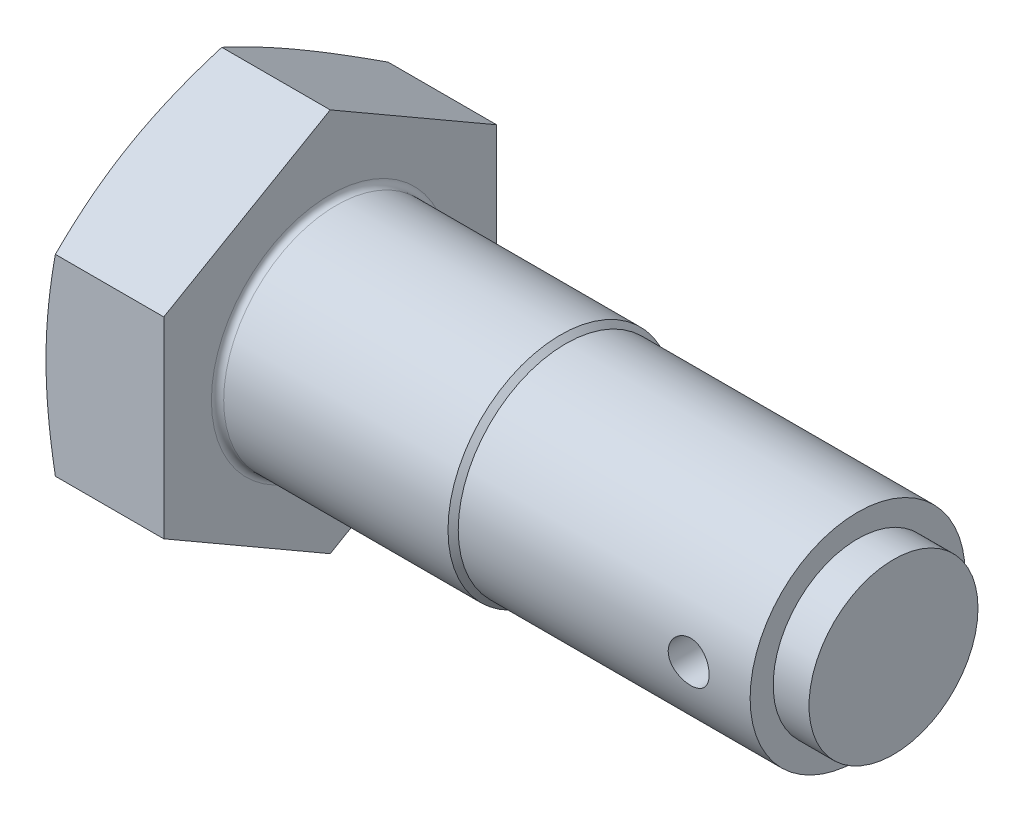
ISO-10303-21;
HEADER;
FILE_DESCRIPTION(('STEP AP214'),'2;1');
FILE_NAME('part.step','',(''),(''),'','','');
FILE_SCHEMA(('AUTOMOTIVE_DESIGN { 1 0 10303 214 1 1 1 1 }'));
ENDSEC;
DATA;
#1=APPLICATION_CONTEXT('core data for automotive mechanical design processes');
#2=APPLICATION_PROTOCOL_DEFINITION('international standard','automotive_design',2000,#1);
#3=PRODUCT_CONTEXT('',#1,'mechanical');
#4=PRODUCT('Part','Part','',(#3));
#5=PRODUCT_RELATED_PRODUCT_CATEGORY('part','',(#4));
#6=PRODUCT_DEFINITION_FORMATION('','',#4);
#7=PRODUCT_DEFINITION_CONTEXT('part definition',#1,'design');
#8=PRODUCT_DEFINITION('design','',#6,#7);
#9=PRODUCT_DEFINITION_SHAPE('','',#8);
#10=(LENGTH_UNIT() NAMED_UNIT(*) SI_UNIT(.MILLI.,.METRE.));
#11=(NAMED_UNIT(*) PLANE_ANGLE_UNIT() SI_UNIT($,.RADIAN.));
#12=(NAMED_UNIT(*) SI_UNIT($,.STERADIAN.) SOLID_ANGLE_UNIT());
#13=UNCERTAINTY_MEASURE_WITH_UNIT(LENGTH_MEASURE(1.E-05),#10,'distance_accuracy_value','');
#14=(GEOMETRIC_REPRESENTATION_CONTEXT(3) GLOBAL_UNCERTAINTY_ASSIGNED_CONTEXT((#13)) GLOBAL_UNIT_ASSIGNED_CONTEXT((#10,
#11,#12)) REPRESENTATION_CONTEXT('',''));
#15=CARTESIAN_POINT('',(0.,0.,0.));
#16=DIRECTION('',(0.,0.,1.));
#17=DIRECTION('',(1.,0.,0.));
#18=AXIS2_PLACEMENT_3D('',#15,#16,#17);
#19=CARTESIAN_POINT('',(23.,-18.7638837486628,32.5));
#20=DIRECTION('',(0.,0.866025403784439,-0.5));
#21=DIRECTION('',(0.,0.5,0.866025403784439));
#22=AXIS2_PLACEMENT_3D('',#19,#20,#21);
#23=PLANE('',#22);
#24=CARTESIAN_POINT('',(1.8299997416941,-37.5278829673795,-0.000199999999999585));
#25=CARTESIAN_POINT('',(1.68857418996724,-37.139311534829,0.672825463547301));
#26=CARTESIAN_POINT('',(1.55351316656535,-36.7501472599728,1.34687776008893));
#27=CARTESIAN_POINT('',(1.29751061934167,-35.9706235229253,2.69705247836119));
#28=CARTESIAN_POINT('',(1.17657043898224,-35.5802639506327,3.37317509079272));
#29=CARTESIAN_POINT('',(0.950141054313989,-34.7981155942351,4.72789578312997));
#30=CARTESIAN_POINT('',(0.844663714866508,-34.4063259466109,5.40649535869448));
#31=CARTESIAN_POINT('',(0.650670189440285,-33.6217048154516,6.76549902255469));
#32=CARTESIAN_POINT('',(0.562153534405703,-33.2288733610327,7.44590306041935));
#33=CARTESIAN_POINT('',(0.404133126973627,-32.4459927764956,8.80189200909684));
#34=CARTESIAN_POINT('',(0.334457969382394,-32.0559523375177,9.47746186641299));
#35=CARTESIAN_POINT('',(0.214136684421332,-31.2751323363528,10.8298817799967));
#36=CARTESIAN_POINT('',(0.163490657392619,-30.8843527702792,11.5067318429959));
#37=CARTESIAN_POINT('',(0.0821085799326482,-30.1024159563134,12.8610861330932));
#38=CARTESIAN_POINT('',(0.0513652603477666,-29.7112588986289,13.5385900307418));
#39=CARTESIAN_POINT('',(0.0103110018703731,-28.9286764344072,14.8940626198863));
#40=CARTESIAN_POINT('',(0.,-28.5372510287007,15.5720313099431));
#41=CARTESIAN_POINT('',(0.,-27.7544002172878,16.9279686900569));
#42=CARTESIAN_POINT('',(0.0103110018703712,-27.3629748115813,17.6059373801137));
#43=CARTESIAN_POINT('',(0.0513652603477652,-26.5803923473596,18.9614099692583));
#44=CARTESIAN_POINT('',(0.0821085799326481,-26.1892352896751,19.6389138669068));
#45=CARTESIAN_POINT('',(0.16349065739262,-25.4072984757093,20.9932681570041));
#46=CARTESIAN_POINT('',(0.214136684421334,-25.0165189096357,21.6701182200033));
#47=CARTESIAN_POINT('',(0.334457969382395,-24.2356989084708,23.022538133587));
#48=CARTESIAN_POINT('',(0.404133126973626,-23.8456584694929,23.6981079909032));
#49=CARTESIAN_POINT('',(0.562153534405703,-23.0627778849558,25.0540969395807));
#50=CARTESIAN_POINT('',(0.650670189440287,-22.6699464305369,25.7345009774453));
#51=CARTESIAN_POINT('',(0.844663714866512,-21.8853252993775,27.0935046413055));
#52=CARTESIAN_POINT('',(0.950141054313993,-21.4935356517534,27.77210421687));
#53=CARTESIAN_POINT('',(1.17657043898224,-20.7113872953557,29.1268249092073));
#54=CARTESIAN_POINT('',(1.29751061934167,-20.3210277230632,29.8029475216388));
#55=CARTESIAN_POINT('',(1.55351316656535,-19.5415039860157,31.1531222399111));
#56=CARTESIAN_POINT('',(1.68857418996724,-19.1523397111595,31.8271745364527));
#57=CARTESIAN_POINT('',(1.82999974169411,-18.763768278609,32.5002));
#58=B_SPLINE_CURVE_WITH_KNOTS('',3,(#24,#25,#26,#27,#28,#29,#30,#31,#32,#33,#34,#35,#36,#37,#38,
#39,#40,#41,#42,#43,#44,#45,#46,#47,#48,#49,#50,#51,#52,#53,#54,#55,#56,#57),.UNSPECIFIED.,.F.,
.F.,(4,2,2,2,2,2,2,2,2,2,2,2,2,2,2,2,4),(0.,2.36973307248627,4.73969141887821,7.11145885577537,
9.48316069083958,11.8324994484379,14.1818505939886,16.5303431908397,18.8788285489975,
21.2273139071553,23.5758065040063,25.925157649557,28.2744964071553,30.6461982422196,
33.0179656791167,35.3879240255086,37.7576570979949),.UNSPECIFIED.);
#59=CARTESIAN_POINT('',(1.8299577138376,-37.5277674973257,0.));
#60=VERTEX_POINT('',#59);
#61=CARTESIAN_POINT('',(0.,-28.1458256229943,16.25));
#62=VERTEX_POINT('',#61);
#63=EDGE_CURVE('E279',#60,#62,#58,.T.);
#64=ORIENTED_EDGE('',*,*,#63,.F.);
#65=DIRECTION('',(-1.,0.,0.));
#66=VECTOR('',#65,1.);
#67=CARTESIAN_POINT('',(23.,-37.5277674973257,0.));
#68=LINE('',#67,#66);
#69=CARTESIAN_POINT('',(23.,-37.5277674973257,0.));
#70=VERTEX_POINT('',#69);
#71=EDGE_CURVE('E149',#70,#60,#68,.T.);
#72=ORIENTED_EDGE('',*,*,#71,.F.);
#73=DIRECTION('',(0.,-0.5,-0.866025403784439));
#74=VECTOR('',#73,1.);
#75=CARTESIAN_POINT('',(23.,-18.7638837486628,32.5));
#76=LINE('',#75,#74);
#77=CARTESIAN_POINT('',(23.,-18.7638837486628,32.5));
#78=VERTEX_POINT('',#77);
#79=EDGE_CURVE('E291',#78,#70,#76,.T.);
#80=ORIENTED_EDGE('',*,*,#79,.F.);
#81=DIRECTION('',(-1.,0.,0.));
#82=VECTOR('',#81,1.);
#83=CARTESIAN_POINT('',(23.,-18.7638837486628,32.5));
#84=LINE('',#83,#82);
#85=CARTESIAN_POINT('',(1.8299577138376,-18.7638837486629,32.5));
#86=VERTEX_POINT('',#85);
#87=EDGE_CURVE('E136',#78,#86,#84,.T.);
#88=ORIENTED_EDGE('',*,*,#87,.T.);
#89=EDGE_CURVE('E130',#62,#86,#58,.T.);
#90=ORIENTED_EDGE('',*,*,#89,.F.);
#91=EDGE_LOOP('',(#64,#72,#80,#88,#90));
#92=FACE_BOUND('',#91,.T.);
#93=ADVANCED_FACE('F35',(#92),#23,.F.);
#94=CARTESIAN_POINT('',(23.,-37.5277674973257,0.));
#95=DIRECTION('',(0.,0.866025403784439,0.5));
#96=DIRECTION('',(0.,-0.5,0.866025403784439));
#97=AXIS2_PLACEMENT_3D('',#94,#95,#96);
#98=PLANE('',#97);
#99=CARTESIAN_POINT('',(1.82999974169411,-18.763768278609,-32.5002));
#100=CARTESIAN_POINT('',(1.68857418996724,-19.1523397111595,-31.8271745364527));
#101=CARTESIAN_POINT('',(1.55351316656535,-19.5415039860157,-31.1531222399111));
#102=CARTESIAN_POINT('',(1.29751061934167,-20.3210277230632,-29.8029475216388));
#103=CARTESIAN_POINT('',(1.17657043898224,-20.7113872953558,-29.1268249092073));
#104=CARTESIAN_POINT('',(0.950141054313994,-21.4935356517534,-27.77210421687));
#105=CARTESIAN_POINT('',(0.844663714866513,-21.8853252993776,-27.0935046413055));
#106=CARTESIAN_POINT('',(0.650670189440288,-22.6699464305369,-25.7345009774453));
#107=CARTESIAN_POINT('',(0.562153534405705,-23.0627778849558,-25.0540969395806));
#108=CARTESIAN_POINT('',(0.404133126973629,-23.8456584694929,-23.6981079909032));
#109=CARTESIAN_POINT('',(0.334457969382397,-24.2356989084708,-23.022538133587));
#110=CARTESIAN_POINT('',(0.214136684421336,-25.0165189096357,-21.6701182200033));
#111=CARTESIAN_POINT('',(0.163490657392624,-25.4072984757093,-20.9932681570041));
#112=CARTESIAN_POINT('',(0.0821085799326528,-26.1892352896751,-19.6389138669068));
#113=CARTESIAN_POINT('',(0.0513652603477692,-26.5803923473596,-18.9614099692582));
#114=CARTESIAN_POINT('',(0.0103110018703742,-27.3629748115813,-17.6059373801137));
#115=CARTESIAN_POINT('',(0.,-27.7544002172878,-16.9279686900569));
#116=CARTESIAN_POINT('',(0.,-28.5372510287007,-15.5720313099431));
#117=CARTESIAN_POINT('',(0.0103110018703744,-28.9286764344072,-14.8940626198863));
#118=CARTESIAN_POINT('',(0.0513652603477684,-29.7112588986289,-13.5385900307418));
#119=CARTESIAN_POINT('',(0.0821085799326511,-30.1024159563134,-12.8610861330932));
#120=CARTESIAN_POINT('',(0.163490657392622,-30.8843527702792,-11.5067318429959));
#121=CARTESIAN_POINT('',(0.214136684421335,-31.2751323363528,-10.8298817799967));
#122=CARTESIAN_POINT('',(0.334457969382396,-32.0559523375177,-9.47746186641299));
#123=CARTESIAN_POINT('',(0.404133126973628,-32.4459927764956,-8.80189200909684));
#124=CARTESIAN_POINT('',(0.562153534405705,-33.2288733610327,-7.44590306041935));
#125=CARTESIAN_POINT('',(0.650670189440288,-33.6217048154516,-6.76549902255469));
#126=CARTESIAN_POINT('',(0.844663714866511,-34.4063259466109,-5.40649535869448));
#127=CARTESIAN_POINT('',(0.950141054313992,-34.7981155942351,-4.72789578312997));
#128=CARTESIAN_POINT('',(1.17657043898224,-35.5802639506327,-3.37317509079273));
#129=CARTESIAN_POINT('',(1.29751061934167,-35.9706235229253,-2.6970524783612));
#130=CARTESIAN_POINT('',(1.55351316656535,-36.7501472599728,-1.34687776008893));
#131=CARTESIAN_POINT('',(1.68857418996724,-37.139311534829,-0.672825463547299));
#132=CARTESIAN_POINT('',(1.8299997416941,-37.5278829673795,0.000200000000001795));
#133=B_SPLINE_CURVE_WITH_KNOTS('',3,(#99,#100,#101,#102,#103,#104,#105,#106,#107,#108,#109,#110,
#111,#112,#113,#114,#115,#116,#117,#118,#119,#120,#121,#122,#123,#124,#125,#126,#127,#128,#129,
#130,#131,#132),.UNSPECIFIED.,.F.,.F.,(4,2,2,2,2,2,2,2,2,2,2,2,2,2,2,2,4),(0.,2.36973307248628,
4.73969141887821,7.11145885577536,9.48316069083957,11.8324994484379,14.1818505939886,
16.5303431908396,18.8788285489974,21.2273139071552,23.5758065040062,25.925157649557,
28.2744964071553,30.6461982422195,33.0179656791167,35.3879240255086,37.7576570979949),.UNSPECIFIED.);
#134=CARTESIAN_POINT('',(1.8299577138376,-18.7638837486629,-32.5));
#135=VERTEX_POINT('',#134);
#136=CARTESIAN_POINT('',(0.,-28.1458256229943,-16.25));
#137=VERTEX_POINT('',#136);
#138=EDGE_CURVE('E226',#135,#137,#133,.T.);
#139=ORIENTED_EDGE('',*,*,#138,.F.);
#140=DIRECTION('',(-1.,0.,0.));
#141=VECTOR('',#140,1.);
#142=CARTESIAN_POINT('',(23.,-18.7638837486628,-32.5));
#143=LINE('',#142,#141);
#144=CARTESIAN_POINT('',(23.,-18.7638837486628,-32.5));
#145=VERTEX_POINT('',#144);
#146=EDGE_CURVE('E146',#145,#135,#143,.T.);
#147=ORIENTED_EDGE('',*,*,#146,.F.);
#148=DIRECTION('',(0.,0.5,-0.866025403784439));
#149=VECTOR('',#148,1.);
#150=CARTESIAN_POINT('',(23.,-37.5277674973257,0.));
#151=LINE('',#150,#149);
#152=EDGE_CURVE('E286',#70,#145,#151,.T.);
#153=ORIENTED_EDGE('',*,*,#152,.F.);
#154=ORIENTED_EDGE('',*,*,#71,.T.);
#155=EDGE_CURVE('E222',#137,#60,#133,.T.);
#156=ORIENTED_EDGE('',*,*,#155,.F.);
#157=EDGE_LOOP('',(#139,#147,#153,#154,#156));
#158=FACE_BOUND('',#157,.T.);
#159=ADVANCED_FACE('F233',(#158),#98,.F.);
#160=CARTESIAN_POINT('',(23.,-18.7638837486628,-32.5));
#161=DIRECTION('',(0.,0.,1.));
#162=DIRECTION('',(0.,-1.,0.));
#163=AXIS2_PLACEMENT_3D('',#160,#161,#162);
#164=PLANE('',#163);
#165=CARTESIAN_POINT('',(9.77856830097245,-49.6801663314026,-32.5));
#166=CARTESIAN_POINT('',(9.55464495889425,-48.9449686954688,-32.5));
#167=CARTESIAN_POINT('',(9.3320725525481,-48.2093583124,-32.5));
#168=CARTESIAN_POINT('',(8.88993929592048,-46.7372286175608,-32.5));
#169=CARTESIAN_POINT('',(8.67037846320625,-46.0007093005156,-32.5));
#170=CARTESIAN_POINT('',(8.23456371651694,-44.5266295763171,-32.5));
#171=CARTESIAN_POINT('',(8.01831006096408,-43.7890690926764,-32.5));
#172=CARTESIAN_POINT('',(7.58949412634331,-42.3128777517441,-32.5));
#173=CARTESIAN_POINT('',(7.37693184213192,-41.5742468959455,-32.5));
#174=CARTESIAN_POINT('',(6.74458886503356,-39.3538448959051,-32.5));
#175=CARTESIAN_POINT('',(6.33096705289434,-37.8703103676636,-32.5));
#176=CARTESIAN_POINT('',(5.52407045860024,-34.8977282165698,-32.5));
#177=CARTESIAN_POINT('',(5.13079531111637,-33.4086806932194,-32.5));
#178=CARTESIAN_POINT('',(4.37434025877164,-30.4424733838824,-32.5));
#179=CARTESIAN_POINT('',(4.01084907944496,-28.9653933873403,-32.5));
#180=CARTESIAN_POINT('',(3.31481275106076,-26.003884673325,-32.5));
#181=CARTESIAN_POINT('',(2.98226812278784,-24.5194558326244,-32.5));
#182=CARTESIAN_POINT('',(2.35587961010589,-21.5429118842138,-32.5));
#183=CARTESIAN_POINT('',(2.06202252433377,-20.0507995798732,-32.5));
#184=CARTESIAN_POINT('',(1.52195385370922,-17.0579267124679,-32.5));
#185=CARTESIAN_POINT('',(1.27574067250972,-15.5571664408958,-32.5));
#186=CARTESIAN_POINT('',(0.865351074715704,-12.7159237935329,-32.5));
#187=CARTESIAN_POINT('',(0.695071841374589,-11.3763367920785,-32.5));
#188=CARTESIAN_POINT('',(0.478866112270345,-9.36278026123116,-32.5));
#189=CARTESIAN_POINT('',(0.413332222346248,-8.69088651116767,-32.5));
#190=CARTESIAN_POINT('',(0.296072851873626,-7.34590138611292,-32.5));
#191=CARTESIAN_POINT('',(0.244347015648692,-6.6728100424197,-32.5));
#192=CARTESIAN_POINT('',(0.155372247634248,-5.32613328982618,-32.5));
#193=CARTESIAN_POINT('',(0.118113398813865,-4.65254853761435,-32.5));
#194=CARTESIAN_POINT('',(0.0585034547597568,-3.3047169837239,-32.5));
#195=CARTESIAN_POINT('',(0.0361523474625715,-2.63047018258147,-32.5));
#196=CARTESIAN_POINT('',(0.00665842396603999,-1.28164516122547,-32.5));
#197=CARTESIAN_POINT('',(-0.000484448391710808,-0.607066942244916,-32.5));
#198=CARTESIAN_POINT('',(0.000535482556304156,0.742078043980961,-32.5));
#199=CARTESIAN_POINT('',(0.00869829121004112,1.4166448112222,-32.5));
#200=CARTESIAN_POINT('',(0.0402981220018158,2.7688400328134,-32.5));
#201=CARTESIAN_POINT('',(0.063812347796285,3.44646667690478,-32.5));
#202=CARTESIAN_POINT('',(0.125870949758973,4.80102827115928,-32.5));
#203=CARTESIAN_POINT('',(0.164415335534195,5.47796322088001,-32.5));
#204=CARTESIAN_POINT('',(0.25603304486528,6.83084823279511,-32.5));
#205=CARTESIAN_POINT('',(0.309106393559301,7.50679829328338,-32.5));
#206=CARTESIAN_POINT('',(0.429124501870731,8.85747203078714,-32.5));
#207=CARTESIAN_POINT('',(0.496069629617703,9.5321956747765,-32.5));
#208=CARTESIAN_POINT('',(0.716699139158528,11.5553242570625,-32.5));
#209=CARTESIAN_POINT('',(0.890102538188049,12.901611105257,-32.5));
#210=CARTESIAN_POINT('',(1.28249994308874,15.5874039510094,-32.5));
#211=CARTESIAN_POINT('',(1.50149419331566,16.9269099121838,-32.5));
#212=CARTESIAN_POINT('',(1.99053903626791,19.6696859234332,-32.5));
#213=CARTESIAN_POINT('',(2.26267752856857,21.072581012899,-32.5));
#214=CARTESIAN_POINT('',(2.84198092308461,23.8711634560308,-32.5));
#215=CARTESIAN_POINT('',(3.14914846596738,25.2668502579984,-32.5));
#216=CARTESIAN_POINT('',(3.79205940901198,28.0520151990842,-32.5));
#217=CARTESIAN_POINT('',(4.1278111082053,29.4414914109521,-32.5));
#218=CARTESIAN_POINT('',(4.82242885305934,32.2145903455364,-32.5));
#219=CARTESIAN_POINT('',(5.18129434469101,33.5982132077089,-32.5));
#220=CARTESIAN_POINT('',(5.91829208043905,36.3622032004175,-32.5));
#221=CARTESIAN_POINT('',(6.29644847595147,37.7425638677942,-32.5));
#222=CARTESIAN_POINT('',(7.06814427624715,40.4989726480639,-32.5));
#223=CARTESIAN_POINT('',(7.46168374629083,41.8750207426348,-32.5));
#224=CARTESIAN_POINT('',(8.26133009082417,44.623202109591,-32.5));
#225=CARTESIAN_POINT('',(8.66743484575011,45.9953360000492,-32.5));
#226=CARTESIAN_POINT('',(9.49009142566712,48.7364599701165,-32.5));
#227=CARTESIAN_POINT('',(9.90664322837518,50.1054500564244,-32.5));
#228=CARTESIAN_POINT('',(10.7438067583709,52.8256473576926,-32.5));
#229=CARTESIAN_POINT('',(11.1643228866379,54.1768840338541,-32.5));
#230=CARTESIAN_POINT('',(12.0125182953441,56.8771051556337,-32.5));
#231=CARTESIAN_POINT('',(12.4401975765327,58.2260896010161,-32.5));
#232=CARTESIAN_POINT('',(13.3016435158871,60.9221799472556,-32.5));
#233=CARTESIAN_POINT('',(13.7354104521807,62.2692857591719,-32.5));
#234=CARTESIAN_POINT('',(14.6081202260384,64.9618200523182,-32.5));
#235=CARTESIAN_POINT('',(15.0470630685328,66.3072485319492,-32.5));
#236=CARTESIAN_POINT('',(15.9277167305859,68.9915427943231,-32.5));
#237=CARTESIAN_POINT('',(16.3694107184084,70.3304141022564,-32.5));
#238=CARTESIAN_POINT('',(17.2566101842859,73.0068935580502,-32.5));
#239=CARTESIAN_POINT('',(17.7021156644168,74.3445017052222,-32.5));
#240=CARTESIAN_POINT('',(18.5963991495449,77.018501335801,-32.5));
#241=CARTESIAN_POINT('',(19.0451768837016,78.3548929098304,-32.5));
#242=CARTESIAN_POINT('',(19.9456362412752,81.0266939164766,-32.5));
#243=CARTESIAN_POINT('',(20.3973178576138,82.3621033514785,-32.5));
#244=CARTESIAN_POINT('',(20.8502501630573,83.6970874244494,-32.5));
#245=B_SPLINE_CURVE_WITH_KNOTS('',3,(#165,#166,#167,#168,#169,#170,#171,#172,#173,#174,#175,
#176,#177,#178,#179,#180,#181,#182,#183,#184,#185,#186,#187,#188,#189,#190,#191,#192,#193,#194,
#195,#196,#197,#198,#199,#200,#201,#202,#203,#204,#205,#206,#207,#208,#209,#210,#211,#212,#213,
#214,#215,#216,#217,#218,#219,#220,#221,#222,#223,#224,#225,#226,#227,#228,#229,#230,#231,#232,
#233,#234,#235,#236,#237,#238,#239,#240,#241,#242,#243,#244),.UNSPECIFIED.,.F.,.F.,(4,2,2,2,2,2,
2,2,2,2,2,2,2,2,2,2,2,2,2,2,2,2,2,2,2,2,2,2,2,2,2,2,2,2,2,2,2,2,2,4),(0.,2.30562725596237,
4.61126795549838,6.9170879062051,9.22290464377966,13.8431310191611,18.4632744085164,
23.0264538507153,27.5897100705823,32.1514051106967,36.7129472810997,40.7630536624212,
42.7881803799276,44.8132549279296,46.8369388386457,48.8606211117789,50.8842959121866,
52.9079714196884,54.9419033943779,56.9758366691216,59.0097734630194,61.0437642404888,
65.1149785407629,69.1862146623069,73.4727979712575,77.7597046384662,82.0478602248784,
86.3359130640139,90.6294728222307,94.9230507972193,99.2159084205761,103.508756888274,
107.754209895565,111.999663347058,116.245311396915,120.490963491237,124.720499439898,
128.950037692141,133.179229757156,137.408411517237),.UNSPECIFIED.);
#246=CARTESIAN_POINT('',(1.8299577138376,18.7638837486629,-32.5));
#247=VERTEX_POINT('',#246);
#248=CARTESIAN_POINT('',(0.,0.,-32.5));
#249=VERTEX_POINT('',#248);
#250=EDGE_CURVE('E307',#247,#249,#245,.F.);
#251=ORIENTED_EDGE('',*,*,#250,.F.);
#252=DIRECTION('',(-1.,0.,0.));
#253=VECTOR('',#252,1.);
#254=CARTESIAN_POINT('',(23.,18.7638837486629,-32.5));
#255=LINE('',#254,#253);
#256=CARTESIAN_POINT('',(23.,18.7638837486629,-32.5));
#257=VERTEX_POINT('',#256);
#258=EDGE_CURVE('E138',#257,#247,#255,.T.);
#259=ORIENTED_EDGE('',*,*,#258,.F.);
#260=DIRECTION('',(0.,1.,0.));
#261=VECTOR('',#260,1.);
#262=CARTESIAN_POINT('',(23.,-18.7638837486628,-32.5));
#263=LINE('',#262,#261);
#264=EDGE_CURVE('E290',#145,#257,#263,.T.);
#265=ORIENTED_EDGE('',*,*,#264,.F.);
#266=ORIENTED_EDGE('',*,*,#146,.T.);
#267=EDGE_CURVE('E227',#249,#135,#245,.F.);
#268=ORIENTED_EDGE('',*,*,#267,.F.);
#269=EDGE_LOOP('',(#251,#259,#265,#266,#268));
#270=FACE_BOUND('',#269,.T.);
#271=ADVANCED_FACE('F236',(#270),#164,.F.);
#272=CARTESIAN_POINT('',(23.,18.7638837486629,-32.5));
#273=DIRECTION('',(0.,-0.866025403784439,0.5));
#274=DIRECTION('',(0.,-0.5,-0.866025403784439));
#275=AXIS2_PLACEMENT_3D('',#272,#273,#274);
#276=PLANE('',#275);
#277=CARTESIAN_POINT('',(1.82999974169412,37.5278829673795,0.00019999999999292));
#278=CARTESIAN_POINT('',(1.68857418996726,37.139311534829,-0.67282546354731));
#279=CARTESIAN_POINT('',(1.55351316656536,36.7501472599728,-1.34687776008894));
#280=CARTESIAN_POINT('',(1.29751061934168,35.9706235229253,-2.6970524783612));
#281=CARTESIAN_POINT('',(1.17657043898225,35.5802639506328,-3.37317509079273));
#282=CARTESIAN_POINT('',(0.950141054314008,34.7981155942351,-4.72789578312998));
#283=CARTESIAN_POINT('',(0.844663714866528,34.406325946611,-5.40649535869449));
#284=CARTESIAN_POINT('',(0.650670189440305,33.6217048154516,-6.76549902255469));
#285=CARTESIAN_POINT('',(0.562153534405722,33.2288733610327,-7.44590306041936));
#286=CARTESIAN_POINT('',(0.404133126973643,32.4459927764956,-8.80189200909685));
#287=CARTESIAN_POINT('',(0.334457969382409,32.0559523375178,-9.47746186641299));
#288=CARTESIAN_POINT('',(0.214136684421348,31.2751323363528,-10.8298817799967));
#289=CARTESIAN_POINT('',(0.163490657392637,30.8843527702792,-11.5067318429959));
#290=CARTESIAN_POINT('',(0.0821085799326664,30.1024159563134,-12.8610861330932));
#291=CARTESIAN_POINT('',(0.0513652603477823,29.711258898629,-13.5385900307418));
#292=CARTESIAN_POINT('',(0.0103110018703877,28.9286764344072,-14.8940626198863));
#293=CARTESIAN_POINT('',(0.,28.5372510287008,-15.5720313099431));
#294=CARTESIAN_POINT('',(0.,27.7544002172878,-16.9279686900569));
#295=CARTESIAN_POINT('',(0.0103110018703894,27.3629748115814,-17.6059373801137));
#296=CARTESIAN_POINT('',(0.0513652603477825,26.5803923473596,-18.9614099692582));
#297=CARTESIAN_POINT('',(0.0821085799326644,26.1892352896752,-19.6389138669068));
#298=CARTESIAN_POINT('',(0.163490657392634,25.4072984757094,-20.9932681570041));
#299=CARTESIAN_POINT('',(0.214136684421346,25.0165189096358,-21.6701182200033));
#300=CARTESIAN_POINT('',(0.334457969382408,24.2356989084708,-23.022538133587));
#301=CARTESIAN_POINT('',(0.40413312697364,23.845658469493,-23.6981079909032));
#302=CARTESIAN_POINT('',(0.562153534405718,23.0627778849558,-25.0540969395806));
#303=CARTESIAN_POINT('',(0.6506701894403,22.669946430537,-25.7345009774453));
#304=CARTESIAN_POINT('',(0.844663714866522,21.8853252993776,-27.0935046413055));
#305=CARTESIAN_POINT('',(0.950141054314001,21.4935356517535,-27.77210421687));
#306=CARTESIAN_POINT('',(1.17657043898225,20.7113872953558,-29.1268249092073));
#307=CARTESIAN_POINT('',(1.29751061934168,20.3210277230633,-29.8029475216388));
#308=CARTESIAN_POINT('',(1.55351316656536,19.5415039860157,-31.1531222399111));
#309=CARTESIAN_POINT('',(1.68857418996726,19.1523397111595,-31.8271745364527));
#310=CARTESIAN_POINT('',(1.82999974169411,18.763768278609,-32.5002));
#311=B_SPLINE_CURVE_WITH_KNOTS('',3,(#277,#278,#279,#280,#281,#282,#283,#284,#285,#286,#287,
#288,#289,#290,#291,#292,#293,#294,#295,#296,#297,#298,#299,#300,#301,#302,#303,#304,#305,#306,
#307,#308,#309,#310),.UNSPECIFIED.,.F.,.F.,(4,2,2,2,2,2,2,2,2,2,2,2,2,2,2,2,4),(0.,
2.36973307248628,4.73969141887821,7.11145885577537,9.48316069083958,11.8324994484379,
14.1818505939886,16.5303431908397,18.8788285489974,21.2273139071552,23.5758065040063,
25.925157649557,28.2744964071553,30.6461982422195,33.0179656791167,35.3879240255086,
37.7576570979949),.UNSPECIFIED.);
#312=CARTESIAN_POINT('',(1.8299577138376,37.5277674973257,0.));
#313=VERTEX_POINT('',#312);
#314=CARTESIAN_POINT('',(0.,28.1458256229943,-16.25));
#315=VERTEX_POINT('',#314);
#316=EDGE_CURVE('E56',#313,#315,#311,.T.);
#317=ORIENTED_EDGE('',*,*,#316,.F.);
#318=DIRECTION('',(-1.,0.,0.));
#319=VECTOR('',#318,1.);
#320=CARTESIAN_POINT('',(23.,37.5277674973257,0.));
#321=LINE('',#320,#319);
#322=CARTESIAN_POINT('',(23.,37.5277674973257,0.));
#323=VERTEX_POINT('',#322);
#324=EDGE_CURVE('E135',#323,#313,#321,.T.);
#325=ORIENTED_EDGE('',*,*,#324,.F.);
#326=DIRECTION('',(0.,0.5,0.866025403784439));
#327=VECTOR('',#326,1.);
#328=CARTESIAN_POINT('',(23.,18.7638837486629,-32.5));
#329=LINE('',#328,#327);
#330=EDGE_CURVE('E299',#257,#323,#329,.T.);
#331=ORIENTED_EDGE('',*,*,#330,.F.);
#332=ORIENTED_EDGE('',*,*,#258,.T.);
#333=EDGE_CURVE('E305',#315,#247,#311,.T.);
#334=ORIENTED_EDGE('',*,*,#333,.F.);
#335=EDGE_LOOP('',(#317,#325,#331,#332,#334));
#336=FACE_BOUND('',#335,.T.);
#337=ADVANCED_FACE('F240',(#336),#276,.F.);
#338=CARTESIAN_POINT('',(23.,37.5277674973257,0.));
#339=DIRECTION('',(0.,-0.866025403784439,-0.5));
#340=DIRECTION('',(0.,0.5,-0.866025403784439));
#341=AXIS2_PLACEMENT_3D('',#338,#339,#340);
#342=PLANE('',#341);
#343=CARTESIAN_POINT('',(1.82999974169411,18.763768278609,32.5002));
#344=CARTESIAN_POINT('',(1.68857418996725,19.1523397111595,31.8271745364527));
#345=CARTESIAN_POINT('',(1.55351316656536,19.5415039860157,31.1531222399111));
#346=CARTESIAN_POINT('',(1.29751061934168,20.3210277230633,29.8029475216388));
#347=CARTESIAN_POINT('',(1.17657043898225,20.7113872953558,29.1268249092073));
#348=CARTESIAN_POINT('',(0.950141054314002,21.4935356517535,27.77210421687));
#349=CARTESIAN_POINT('',(0.844663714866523,21.8853252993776,27.0935046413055));
#350=CARTESIAN_POINT('',(0.6506701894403,22.669946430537,25.7345009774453));
#351=CARTESIAN_POINT('',(0.562153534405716,23.0627778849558,25.0540969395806));
#352=CARTESIAN_POINT('',(0.404133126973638,23.845658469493,23.6981079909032));
#353=CARTESIAN_POINT('',(0.334457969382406,24.2356989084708,23.022538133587));
#354=CARTESIAN_POINT('',(0.214136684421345,25.0165189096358,21.6701182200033));
#355=CARTESIAN_POINT('',(0.163490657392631,25.4072984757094,20.9932681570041));
#356=CARTESIAN_POINT('',(0.0821085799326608,26.1892352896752,19.6389138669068));
#357=CARTESIAN_POINT('',(0.0513652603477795,26.5803923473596,18.9614099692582));
#358=CARTESIAN_POINT('',(0.0103110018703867,27.3629748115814,17.6059373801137));
#359=CARTESIAN_POINT('',(0.,27.7544002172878,16.9279686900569));
#360=CARTESIAN_POINT('',(0.,28.5372510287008,15.5720313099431));
#361=CARTESIAN_POINT('',(0.0103110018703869,28.9286764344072,14.8940626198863));
#362=CARTESIAN_POINT('',(0.0513652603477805,29.711258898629,13.5385900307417));
#363=CARTESIAN_POINT('',(0.0821085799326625,30.1024159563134,12.8610861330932));
#364=CARTESIAN_POINT('',(0.163490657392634,30.8843527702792,11.5067318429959));
#365=CARTESIAN_POINT('',(0.214136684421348,31.2751323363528,10.8298817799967));
#366=CARTESIAN_POINT('',(0.33445796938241,32.0559523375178,9.47746186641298));
#367=CARTESIAN_POINT('',(0.404133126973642,32.4459927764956,8.80189200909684));
#368=CARTESIAN_POINT('',(0.562153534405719,33.2288733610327,7.44590306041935));
#369=CARTESIAN_POINT('',(0.650670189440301,33.6217048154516,6.76549902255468));
#370=CARTESIAN_POINT('',(0.844663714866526,34.406325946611,5.40649535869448));
#371=CARTESIAN_POINT('',(0.950141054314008,34.7981155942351,4.72789578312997));
#372=CARTESIAN_POINT('',(1.17657043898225,35.5802639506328,3.37317509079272));
#373=CARTESIAN_POINT('',(1.29751061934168,35.9706235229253,2.69705247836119));
#374=CARTESIAN_POINT('',(1.55351316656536,36.7501472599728,1.34687776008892));
#375=CARTESIAN_POINT('',(1.68857418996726,37.139311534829,0.672825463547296));
#376=CARTESIAN_POINT('',(1.82999974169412,37.5278829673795,-0.000200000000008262));
#377=B_SPLINE_CURVE_WITH_KNOTS('',3,(#343,#344,#345,#346,#347,#348,#349,#350,#351,#352,#353,
#354,#355,#356,#357,#358,#359,#360,#361,#362,#363,#364,#365,#366,#367,#368,#369,#370,#371,#372,
#373,#374,#375,#376),.UNSPECIFIED.,.F.,.F.,(4,2,2,2,2,2,2,2,2,2,2,2,2,2,2,2,4),(0.,
2.36973307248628,4.73969141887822,7.11145885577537,9.48316069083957,11.8324994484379,
14.1818505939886,16.5303431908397,18.8788285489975,21.2273139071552,23.5758065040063,
25.925157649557,28.2744964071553,30.6461982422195,33.0179656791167,35.3879240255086,
37.7576570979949),.UNSPECIFIED.);
#378=CARTESIAN_POINT('',(1.8299577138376,18.7638837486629,32.5));
#379=VERTEX_POINT('',#378);
#380=CARTESIAN_POINT('',(0.,28.1458256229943,16.25));
#381=VERTEX_POINT('',#380);
#382=EDGE_CURVE('E64',#379,#381,#377,.T.);
#383=ORIENTED_EDGE('',*,*,#382,.F.);
#384=DIRECTION('',(-1.,0.,0.));
#385=VECTOR('',#384,1.);
#386=CARTESIAN_POINT('',(23.,18.7638837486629,32.5));
#387=LINE('',#386,#385);
#388=CARTESIAN_POINT('',(23.,18.7638837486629,32.5));
#389=VERTEX_POINT('',#388);
#390=EDGE_CURVE('E126',#389,#379,#387,.T.);
#391=ORIENTED_EDGE('',*,*,#390,.F.);
#392=DIRECTION('',(0.,-0.5,0.866025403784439));
#393=VECTOR('',#392,1.);
#394=CARTESIAN_POINT('',(23.,37.5277674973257,0.));
#395=LINE('',#394,#393);
#396=EDGE_CURVE('E301',#323,#389,#395,.T.);
#397=ORIENTED_EDGE('',*,*,#396,.F.);
#398=ORIENTED_EDGE('',*,*,#324,.T.);
#399=EDGE_CURVE('E129',#381,#313,#377,.T.);
#400=ORIENTED_EDGE('',*,*,#399,.F.);
#401=EDGE_LOOP('',(#383,#391,#397,#398,#400));
#402=FACE_BOUND('',#401,.T.);
#403=ADVANCED_FACE('F124',(#402),#342,.F.);
#404=CARTESIAN_POINT('',(23.,18.7638837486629,32.5));
#405=DIRECTION('',(0.,0.,-1.));
#406=DIRECTION('',(-1.,0.,0.));
#407=AXIS2_PLACEMENT_3D('',#404,#405,#406);
#408=PLANE('',#407);
#409=CARTESIAN_POINT('',(9.77856830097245,-49.6801663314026,32.5));
#410=CARTESIAN_POINT('',(9.55464495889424,-48.9449686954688,32.5));
#411=CARTESIAN_POINT('',(9.3320725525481,-48.2093583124,32.5));
#412=CARTESIAN_POINT('',(8.88993929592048,-46.7372286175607,32.5));
#413=CARTESIAN_POINT('',(8.67037846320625,-46.0007093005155,32.5));
#414=CARTESIAN_POINT('',(8.23456371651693,-44.5266295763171,32.5));
#415=CARTESIAN_POINT('',(8.01831006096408,-43.7890690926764,32.5));
#416=CARTESIAN_POINT('',(7.5894941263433,-42.3128777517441,32.5));
#417=CARTESIAN_POINT('',(7.37693184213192,-41.5742468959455,32.5));
#418=CARTESIAN_POINT('',(6.74458886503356,-39.353844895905,32.5));
#419=CARTESIAN_POINT('',(6.33096705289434,-37.8703103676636,32.5));
#420=CARTESIAN_POINT('',(5.52407045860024,-34.8977282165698,32.5));
#421=CARTESIAN_POINT('',(5.13079531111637,-33.4086806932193,32.5));
#422=CARTESIAN_POINT('',(4.37434025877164,-30.4424733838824,32.5));
#423=CARTESIAN_POINT('',(4.01084907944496,-28.9653933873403,32.5));
#424=CARTESIAN_POINT('',(3.31481275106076,-26.003884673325,32.5));
#425=CARTESIAN_POINT('',(2.98226812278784,-24.5194558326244,32.5));
#426=CARTESIAN_POINT('',(2.35587961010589,-21.5429118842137,32.5));
#427=CARTESIAN_POINT('',(2.06202252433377,-20.0507995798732,32.5));
#428=CARTESIAN_POINT('',(1.52195385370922,-17.0579267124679,32.5));
#429=CARTESIAN_POINT('',(1.27574067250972,-15.5571664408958,32.5));
#430=CARTESIAN_POINT('',(0.865351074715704,-12.7159237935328,32.5));
#431=CARTESIAN_POINT('',(0.695071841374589,-11.3763367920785,32.5));
#432=CARTESIAN_POINT('',(0.478866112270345,-9.36278026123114,32.5));
#433=CARTESIAN_POINT('',(0.413332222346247,-8.69088651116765,32.5));
#434=CARTESIAN_POINT('',(0.296072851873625,-7.3459013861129,32.5));
#435=CARTESIAN_POINT('',(0.244347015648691,-6.67281004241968,32.5));
#436=CARTESIAN_POINT('',(0.155372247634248,-5.32613328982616,32.5));
#437=CARTESIAN_POINT('',(0.118113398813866,-4.65254853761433,32.5));
#438=CARTESIAN_POINT('',(0.0585034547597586,-3.30471698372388,32.5));
#439=CARTESIAN_POINT('',(0.036152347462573,-2.63047018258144,32.5));
#440=CARTESIAN_POINT('',(0.00665842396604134,-1.28164516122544,32.5));
#441=CARTESIAN_POINT('',(-0.000484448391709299,-0.607066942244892,32.5));
#442=CARTESIAN_POINT('',(0.000535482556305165,0.742078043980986,32.5));
#443=CARTESIAN_POINT('',(0.00869829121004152,1.41664481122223,32.5));
#444=CARTESIAN_POINT('',(0.0402981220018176,2.76884003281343,32.5));
#445=CARTESIAN_POINT('',(0.0638123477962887,3.4464666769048,32.5));
#446=CARTESIAN_POINT('',(0.125870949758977,4.8010282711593,32.5));
#447=CARTESIAN_POINT('',(0.164415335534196,5.47796322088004,32.5));
#448=CARTESIAN_POINT('',(0.25603304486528,6.83084823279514,32.5));
#449=CARTESIAN_POINT('',(0.309106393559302,7.50679829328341,32.5));
#450=CARTESIAN_POINT('',(0.429124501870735,8.85747203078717,32.5));
#451=CARTESIAN_POINT('',(0.496069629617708,9.53219567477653,32.5));
#452=CARTESIAN_POINT('',(0.716699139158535,11.5553242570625,32.5));
#453=CARTESIAN_POINT('',(0.890102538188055,12.901611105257,32.5));
#454=CARTESIAN_POINT('',(1.28249994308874,15.5874039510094,32.5));
#455=CARTESIAN_POINT('',(1.50149419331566,16.9269099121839,32.5));
#456=CARTESIAN_POINT('',(1.99053903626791,19.6696859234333,32.5));
#457=CARTESIAN_POINT('',(2.26267752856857,21.072581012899,32.5));
#458=CARTESIAN_POINT('',(2.84198092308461,23.8711634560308,32.5));
#459=CARTESIAN_POINT('',(3.14914846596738,25.2668502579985,32.5));
#460=CARTESIAN_POINT('',(3.79205940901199,28.0520151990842,32.5));
#461=CARTESIAN_POINT('',(4.12781110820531,29.4414914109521,32.5));
#462=CARTESIAN_POINT('',(4.82242885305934,32.2145903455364,32.5));
#463=CARTESIAN_POINT('',(5.18129434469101,33.5982132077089,32.5));
#464=CARTESIAN_POINT('',(5.91829208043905,36.3622032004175,32.5));
#465=CARTESIAN_POINT('',(6.29644847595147,37.7425638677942,32.5));
#466=CARTESIAN_POINT('',(7.06814427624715,40.4989726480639,32.5));
#467=CARTESIAN_POINT('',(7.46168374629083,41.8750207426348,32.5));
#468=CARTESIAN_POINT('',(8.26133009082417,44.623202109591,32.5));
#469=CARTESIAN_POINT('',(8.66743484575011,45.9953360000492,32.5));
#470=CARTESIAN_POINT('',(9.49009142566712,48.7364599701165,32.5));
#471=CARTESIAN_POINT('',(9.90664322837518,50.1054500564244,32.5));
#472=CARTESIAN_POINT('',(10.7438067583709,52.8256473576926,32.5));
#473=CARTESIAN_POINT('',(11.1643228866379,54.1768840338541,32.5));
#474=CARTESIAN_POINT('',(12.0125182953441,56.8771051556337,32.5));
#475=CARTESIAN_POINT('',(12.4401975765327,58.2260896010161,32.5));
#476=CARTESIAN_POINT('',(13.3016435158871,60.9221799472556,32.5));
#477=CARTESIAN_POINT('',(13.7354104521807,62.2692857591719,32.5));
#478=CARTESIAN_POINT('',(14.6081202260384,64.9618200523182,32.5));
#479=CARTESIAN_POINT('',(15.0470630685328,66.3072485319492,32.5));
#480=CARTESIAN_POINT('',(15.9277167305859,68.9915427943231,32.5));
#481=CARTESIAN_POINT('',(16.3694107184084,70.3304141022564,32.5));
#482=CARTESIAN_POINT('',(17.2566101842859,73.0068935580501,32.5));
#483=CARTESIAN_POINT('',(17.7021156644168,74.3445017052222,32.5));
#484=CARTESIAN_POINT('',(18.5963991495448,77.018501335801,32.5));
#485=CARTESIAN_POINT('',(19.0451768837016,78.3548929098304,32.5));
#486=CARTESIAN_POINT('',(19.9456362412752,81.0266939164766,32.5));
#487=CARTESIAN_POINT('',(20.3973178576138,82.3621033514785,32.5));
#488=CARTESIAN_POINT('',(20.8502501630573,83.6970874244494,32.5));
#489=B_SPLINE_CURVE_WITH_KNOTS('',3,(#409,#410,#411,#412,#413,#414,#415,#416,#417,#418,#419,
#420,#421,#422,#423,#424,#425,#426,#427,#428,#429,#430,#431,#432,#433,#434,#435,#436,#437,#438,
#439,#440,#441,#442,#443,#444,#445,#446,#447,#448,#449,#450,#451,#452,#453,#454,#455,#456,#457,
#458,#459,#460,#461,#462,#463,#464,#465,#466,#467,#468,#469,#470,#471,#472,#473,#474,#475,#476,
#477,#478,#479,#480,#481,#482,#483,#484,#485,#486,#487,#488),.UNSPECIFIED.,.F.,.F.,(4,2,2,2,2,2,
2,2,2,2,2,2,2,2,2,2,2,2,2,2,2,2,2,2,2,2,2,2,2,2,2,2,2,2,2,2,2,2,2,4),(0.,2.30562725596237,
4.61126795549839,6.91708790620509,9.22290464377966,13.8431310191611,18.4632744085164,
23.0264538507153,27.5897100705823,32.1514051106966,36.7129472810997,40.7630536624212,
42.7881803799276,44.8132549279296,46.8369388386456,48.8606211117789,50.8842959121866,
52.9079714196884,54.9419033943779,56.9758366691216,59.0097734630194,61.0437642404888,
65.1149785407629,69.1862146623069,73.4727979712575,77.7597046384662,82.0478602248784,
86.3359130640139,90.6294728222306,94.9230507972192,99.2159084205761,103.508756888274,
107.754209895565,111.999663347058,116.245311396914,120.490963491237,124.720499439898,
128.95003769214,133.179229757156,137.408411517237),.UNSPECIFIED.);
#490=CARTESIAN_POINT('',(0.,0.,32.5));
#491=VERTEX_POINT('',#490);
#492=EDGE_CURVE('E119',#86,#491,#489,.T.);
#493=ORIENTED_EDGE('',*,*,#492,.F.);
#494=ORIENTED_EDGE('',*,*,#87,.F.);
#495=DIRECTION('',(0.,-1.,0.));
#496=VECTOR('',#495,1.);
#497=CARTESIAN_POINT('',(23.,18.7638837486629,32.5));
#498=LINE('',#497,#496);
#499=EDGE_CURVE('E134',#389,#78,#498,.T.);
#500=ORIENTED_EDGE('',*,*,#499,.F.);
#501=ORIENTED_EDGE('',*,*,#390,.T.);
#502=EDGE_CURVE('E111',#491,#379,#489,.T.);
#503=ORIENTED_EDGE('',*,*,#502,.F.);
#504=EDGE_LOOP('',(#493,#494,#500,#501,#503));
#505=FACE_BOUND('',#504,.T.);
#506=ADVANCED_FACE('F132',(#505),#408,.F.);
#507=CARTESIAN_POINT('',(302.39696961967,0.,0.));
#508=DIRECTION('',(-1.,0.,0.));
#509=DIRECTION('',(0.,0.,1.));
#510=AXIS2_PLACEMENT_3D('',#507,#508,#509);
#511=CYLINDRICAL_SURFACE('',#510,21.);
#512=CARTESIAN_POINT('',(118.,0.,21.));
#513=CARTESIAN_POINT('',(117.999991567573,-0.222525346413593,20.9999959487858));
#514=CARTESIAN_POINT('',(117.981368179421,-0.445159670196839,20.9964265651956));
#515=CARTESIAN_POINT('',(117.907417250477,-0.884150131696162,20.9825316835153));
#516=CARTESIAN_POINT('',(117.852059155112,-1.10050088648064,20.972200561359));
#517=CARTESIAN_POINT('',(117.706398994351,-1.52051236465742,20.9459373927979));
#518=CARTESIAN_POINT('',(117.616128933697,-1.72418451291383,20.9300104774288));
#519=CARTESIAN_POINT('',(117.403299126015,-2.11347489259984,20.8942931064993));
#520=CARTESIAN_POINT('',(117.280741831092,-2.29909449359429,20.8745029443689));
#521=CARTESIAN_POINT('',(117.005211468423,-2.6493190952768,20.8329689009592));
#522=CARTESIAN_POINT('',(116.851917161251,-2.81366912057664,20.8112058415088));
#523=CARTESIAN_POINT('',(116.519955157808,-3.11448301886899,20.7683205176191));
#524=CARTESIAN_POINT('',(116.341285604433,-3.2509448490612,20.7471983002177));
#525=CARTESIAN_POINT('',(115.961835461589,-3.49317498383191,20.7077995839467));
#526=CARTESIAN_POINT('',(115.76088581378,-3.5986828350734,20.689547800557));
#527=CARTESIAN_POINT('',(115.343707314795,-3.77434242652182,20.6582272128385));
#528=CARTESIAN_POINT('',(115.127479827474,-3.84449731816,20.6451579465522));
#529=CARTESIAN_POINT('',(114.688615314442,-3.94663904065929,20.6258754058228));
#530=CARTESIAN_POINT('',(114.466085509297,-3.97907116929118,20.6195822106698));
#531=CARTESIAN_POINT('',(114.018660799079,-4.00622913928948,20.6143234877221));
#532=CARTESIAN_POINT('',(113.793766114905,-4.00095847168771,20.6153572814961));
#533=CARTESIAN_POINT('',(113.351229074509,-3.95322129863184,20.6245630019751));
#534=CARTESIAN_POINT('',(113.133529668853,-3.91126210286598,20.6326375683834));
#535=CARTESIAN_POINT('',(112.708317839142,-3.79213830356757,20.6548620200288));
#536=CARTESIAN_POINT('',(112.50080586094,-3.71497216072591,20.6690121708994));
#537=CARTESIAN_POINT('',(112.100380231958,-3.52713153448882,20.7018946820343));
#538=CARTESIAN_POINT('',(111.907564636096,-3.41625308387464,20.7206547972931));
#539=CARTESIAN_POINT('',(111.54308468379,-3.1642794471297,20.7606252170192));
#540=CARTESIAN_POINT('',(111.371422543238,-3.02318109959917,20.7818357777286));
#541=CARTESIAN_POINT('',(111.051192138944,-2.71204215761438,20.8247408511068));
#542=CARTESIAN_POINT('',(110.903045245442,-2.54156786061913,20.8464376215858));
#543=CARTESIAN_POINT('',(110.637387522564,-2.17796507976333,20.8875534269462));
#544=CARTESIAN_POINT('',(110.519877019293,-1.9848363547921,20.9069724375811));
#545=CARTESIAN_POINT('',(110.318762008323,-1.58096076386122,20.9413858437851));
#546=CARTESIAN_POINT('',(110.235202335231,-1.37019104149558,20.9563743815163));
#547=CARTESIAN_POINT('',(110.10479235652,-0.937257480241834,20.9801929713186));
#548=CARTESIAN_POINT('',(110.057938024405,-0.715094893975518,20.9890236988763));
#549=CARTESIAN_POINT('',(110.002857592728,-0.269306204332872,20.9994386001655));
#550=CARTESIAN_POINT('',(109.994054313,-0.0457538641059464,21.0011310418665));
#551=CARTESIAN_POINT('',(110.013776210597,0.399628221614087,20.997378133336));
#552=CARTESIAN_POINT('',(110.042299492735,0.621458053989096,20.9919331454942));
#553=CARTESIAN_POINT('',(110.135385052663,1.05526017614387,20.9745846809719));
#554=CARTESIAN_POINT('',(110.199654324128,1.26729762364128,20.962733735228));
#555=CARTESIAN_POINT('',(110.362089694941,1.67758742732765,20.9338968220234));
#556=CARTESIAN_POINT('',(110.460258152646,1.87583882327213,20.9169104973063));
#557=CARTESIAN_POINT('',(110.688976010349,2.25538540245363,20.879416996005));
#558=CARTESIAN_POINT('',(110.819876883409,2.43646501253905,20.8588724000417));
#559=CARTESIAN_POINT('',(111.109869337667,2.7742949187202,20.8166357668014));
#560=CARTESIAN_POINT('',(111.268963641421,2.93104286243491,20.7949436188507));
#561=CARTESIAN_POINT('',(111.613443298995,3.21796115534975,20.752496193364));
#562=CARTESIAN_POINT('',(111.799159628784,3.34773705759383,20.7317578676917));
#563=CARTESIAN_POINT('',(112.1900951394,3.57425129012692,20.693911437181));
#564=CARTESIAN_POINT('',(112.395313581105,3.6709908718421,20.6768031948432));
#565=CARTESIAN_POINT('',(112.818441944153,3.8281319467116,20.6482879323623));
#566=CARTESIAN_POINT('',(113.036283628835,3.88871186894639,20.636852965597));
#567=CARTESIAN_POINT('',(113.479292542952,3.97236222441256,20.6209161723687));
#568=CARTESIAN_POINT('',(113.704458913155,3.99543704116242,20.6164135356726));
#569=CARTESIAN_POINT('',(114.151772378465,4.00327185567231,20.6148932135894));
#570=CARTESIAN_POINT('',(114.373908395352,3.98865429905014,20.6177539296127));
#571=CARTESIAN_POINT('',(114.812494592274,3.92288461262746,20.6303678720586));
#572=CARTESIAN_POINT('',(115.028944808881,3.87173271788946,20.640121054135));
#573=CARTESIAN_POINT('',(115.44966609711,3.73461253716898,20.6653690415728));
#574=CARTESIAN_POINT('',(115.653960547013,3.64871373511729,20.6808523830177));
#575=CARTESIAN_POINT('',(116.045336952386,3.44460692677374,20.7158238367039));
#576=CARTESIAN_POINT('',(116.232417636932,3.32639653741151,20.735312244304));
#577=CARTESIAN_POINT('',(116.58716963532,3.05886697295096,20.7764741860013));
#578=CARTESIAN_POINT('',(116.75449661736,2.90909560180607,20.7981768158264));
#579=CARTESIAN_POINT('',(117.061850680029,2.58363633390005,20.8411062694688));
#580=CARTESIAN_POINT('',(117.201871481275,2.40794249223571,20.8623329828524));
#581=CARTESIAN_POINT('',(117.451863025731,2.03365875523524,20.9021516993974));
#582=CARTESIAN_POINT('',(117.561540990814,1.83487040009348,20.9207172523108));
#583=CARTESIAN_POINT('',(117.745765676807,1.42139577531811,20.9528630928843));
#584=CARTESIAN_POINT('',(117.820345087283,1.20672451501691,20.9664480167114));
#585=CARTESIAN_POINT('',(117.917274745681,0.826213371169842,20.9843625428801));
#586=CARTESIAN_POINT('',(117.948243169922,0.662584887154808,20.9901931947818));
#587=CARTESIAN_POINT('',(117.989608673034,0.332657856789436,20.9980133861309));
#588=CARTESIAN_POINT('',(118.000006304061,0.166359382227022,21.0000030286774));
#589=CARTESIAN_POINT('',(118.,0.,21.));
#590=B_SPLINE_CURVE_WITH_KNOTS('',3,(#512,#513,#514,#515,#516,#517,#518,#519,#520,#521,#522,
#523,#524,#525,#526,#527,#528,#529,#530,#531,#532,#533,#534,#535,#536,#537,#538,#539,#540,#541,
#542,#543,#544,#545,#546,#547,#548,#549,#550,#551,#552,#553,#554,#555,#556,#557,#558,#559,#560,
#561,#562,#563,#564,#565,#566,#567,#568,#569,#570,#571,#572,#573,#574,#575,#576,#577,#578,#579,
#580,#581,#582,#583,#584,#585,#586,#587,#588,#589),.UNSPECIFIED.,.T.,.F.,(4,2,2,2,2,2,2,2,2,2,2,
2,2,2,2,2,2,2,2,2,2,2,2,2,2,2,2,2,2,2,2,2,2,2,2,2,2,2,4),(0.,0.666967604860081,1.33449066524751,
2.00140323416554,2.6682651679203,3.34249856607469,4.01678133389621,4.69658484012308,
5.37632773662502,6.04796246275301,6.71953500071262,7.3819656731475,8.04442531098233,
8.71097554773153,9.37759554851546,10.0550659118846,10.7325434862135,11.4109128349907,
12.0892077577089,12.7571769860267,13.4251123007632,14.0876516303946,14.7502370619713,
15.4202680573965,16.0903637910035,16.7696596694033,17.4489298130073,18.1248197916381,
18.8006307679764,19.4653532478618,20.1300714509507,20.7934669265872,21.4569113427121,
22.130600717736,22.8044448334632,23.4845805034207,24.1640814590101,24.6627181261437,
25.1613414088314),.UNSPECIFIED.);
#591=CARTESIAN_POINT('',(118.,0.,21.));
#592=VERTEX_POINT('',#591);
#593=EDGE_CURVE('E39',#592,#592,#590,.T.);
#594=ORIENTED_EDGE('',*,*,#593,.T.);
#595=EDGE_LOOP('',(#594));
#596=FACE_BOUND('',#595,.T.);
#597=CARTESIAN_POINT('',(118.,0.,-21.));
#598=CARTESIAN_POINT('',(117.999991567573,0.222525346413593,-20.9999959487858));
#599=CARTESIAN_POINT('',(117.981368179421,0.445159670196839,-20.9964265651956));
#600=CARTESIAN_POINT('',(117.907417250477,0.884150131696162,-20.9825316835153));
#601=CARTESIAN_POINT('',(117.852059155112,1.10050088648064,-20.972200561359));
#602=CARTESIAN_POINT('',(117.706398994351,1.52051236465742,-20.9459373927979));
#603=CARTESIAN_POINT('',(117.616128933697,1.72418451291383,-20.9300104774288));
#604=CARTESIAN_POINT('',(117.403299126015,2.11347489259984,-20.8942931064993));
#605=CARTESIAN_POINT('',(117.280741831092,2.29909449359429,-20.8745029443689));
#606=CARTESIAN_POINT('',(117.005211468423,2.6493190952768,-20.8329689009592));
#607=CARTESIAN_POINT('',(116.851917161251,2.81366912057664,-20.8112058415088));
#608=CARTESIAN_POINT('',(116.519955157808,3.11448301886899,-20.7683205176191));
#609=CARTESIAN_POINT('',(116.341285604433,3.2509448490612,-20.7471983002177));
#610=CARTESIAN_POINT('',(115.961835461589,3.49317498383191,-20.7077995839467));
#611=CARTESIAN_POINT('',(115.76088581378,3.5986828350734,-20.689547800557));
#612=CARTESIAN_POINT('',(115.343707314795,3.77434242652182,-20.6582272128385));
#613=CARTESIAN_POINT('',(115.127479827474,3.84449731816,-20.6451579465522));
#614=CARTESIAN_POINT('',(114.688615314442,3.94663904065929,-20.6258754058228));
#615=CARTESIAN_POINT('',(114.466085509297,3.97907116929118,-20.6195822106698));
#616=CARTESIAN_POINT('',(114.018660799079,4.00622913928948,-20.6143234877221));
#617=CARTESIAN_POINT('',(113.793766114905,4.00095847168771,-20.6153572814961));
#618=CARTESIAN_POINT('',(113.351229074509,3.95322129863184,-20.6245630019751));
#619=CARTESIAN_POINT('',(113.133529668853,3.91126210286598,-20.6326375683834));
#620=CARTESIAN_POINT('',(112.708317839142,3.79213830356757,-20.6548620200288));
#621=CARTESIAN_POINT('',(112.50080586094,3.71497216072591,-20.6690121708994));
#622=CARTESIAN_POINT('',(112.100380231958,3.52713153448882,-20.7018946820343));
#623=CARTESIAN_POINT('',(111.907564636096,3.41625308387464,-20.7206547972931));
#624=CARTESIAN_POINT('',(111.54308468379,3.1642794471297,-20.7606252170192));
#625=CARTESIAN_POINT('',(111.371422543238,3.02318109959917,-20.7818357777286));
#626=CARTESIAN_POINT('',(111.051192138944,2.71204215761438,-20.8247408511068));
#627=CARTESIAN_POINT('',(110.903045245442,2.54156786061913,-20.8464376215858));
#628=CARTESIAN_POINT('',(110.637387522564,2.17796507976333,-20.8875534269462));
#629=CARTESIAN_POINT('',(110.519877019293,1.9848363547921,-20.9069724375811));
#630=CARTESIAN_POINT('',(110.318762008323,1.58096076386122,-20.9413858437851));
#631=CARTESIAN_POINT('',(110.235202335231,1.37019104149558,-20.9563743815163));
#632=CARTESIAN_POINT('',(110.10479235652,0.937257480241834,-20.9801929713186));
#633=CARTESIAN_POINT('',(110.057938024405,0.715094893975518,-20.9890236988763));
#634=CARTESIAN_POINT('',(110.002857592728,0.269306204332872,-20.9994386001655));
#635=CARTESIAN_POINT('',(109.994054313,0.0457538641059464,-21.0011310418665));
#636=CARTESIAN_POINT('',(110.013776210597,-0.399628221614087,-20.997378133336));
#637=CARTESIAN_POINT('',(110.042299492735,-0.621458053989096,-20.9919331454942));
#638=CARTESIAN_POINT('',(110.135385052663,-1.05526017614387,-20.9745846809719));
#639=CARTESIAN_POINT('',(110.199654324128,-1.26729762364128,-20.962733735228));
#640=CARTESIAN_POINT('',(110.362089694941,-1.67758742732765,-20.9338968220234));
#641=CARTESIAN_POINT('',(110.460258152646,-1.87583882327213,-20.9169104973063));
#642=CARTESIAN_POINT('',(110.688976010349,-2.25538540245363,-20.879416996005));
#643=CARTESIAN_POINT('',(110.819876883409,-2.43646501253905,-20.8588724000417));
#644=CARTESIAN_POINT('',(111.109869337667,-2.7742949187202,-20.8166357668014));
#645=CARTESIAN_POINT('',(111.268963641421,-2.93104286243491,-20.7949436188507));
#646=CARTESIAN_POINT('',(111.613443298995,-3.21796115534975,-20.752496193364));
#647=CARTESIAN_POINT('',(111.799159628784,-3.34773705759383,-20.7317578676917));
#648=CARTESIAN_POINT('',(112.1900951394,-3.57425129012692,-20.693911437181));
#649=CARTESIAN_POINT('',(112.395313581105,-3.6709908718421,-20.6768031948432));
#650=CARTESIAN_POINT('',(112.818441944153,-3.8281319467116,-20.6482879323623));
#651=CARTESIAN_POINT('',(113.036283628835,-3.88871186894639,-20.636852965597));
#652=CARTESIAN_POINT('',(113.479292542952,-3.97236222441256,-20.6209161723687));
#653=CARTESIAN_POINT('',(113.704458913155,-3.99543704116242,-20.6164135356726));
#654=CARTESIAN_POINT('',(114.151772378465,-4.00327185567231,-20.6148932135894));
#655=CARTESIAN_POINT('',(114.373908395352,-3.98865429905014,-20.6177539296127));
#656=CARTESIAN_POINT('',(114.812494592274,-3.92288461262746,-20.6303678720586));
#657=CARTESIAN_POINT('',(115.028944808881,-3.87173271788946,-20.640121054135));
#658=CARTESIAN_POINT('',(115.44966609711,-3.73461253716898,-20.6653690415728));
#659=CARTESIAN_POINT('',(115.653960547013,-3.64871373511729,-20.6808523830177));
#660=CARTESIAN_POINT('',(116.045336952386,-3.44460692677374,-20.7158238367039));
#661=CARTESIAN_POINT('',(116.232417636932,-3.32639653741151,-20.735312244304));
#662=CARTESIAN_POINT('',(116.58716963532,-3.05886697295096,-20.7764741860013));
#663=CARTESIAN_POINT('',(116.75449661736,-2.90909560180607,-20.7981768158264));
#664=CARTESIAN_POINT('',(117.061850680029,-2.58363633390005,-20.8411062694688));
#665=CARTESIAN_POINT('',(117.201871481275,-2.40794249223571,-20.8623329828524));
#666=CARTESIAN_POINT('',(117.451863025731,-2.03365875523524,-20.9021516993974));
#667=CARTESIAN_POINT('',(117.561540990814,-1.83487040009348,-20.9207172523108));
#668=CARTESIAN_POINT('',(117.745765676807,-1.42139577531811,-20.9528630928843));
#669=CARTESIAN_POINT('',(117.820345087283,-1.20672451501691,-20.9664480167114));
#670=CARTESIAN_POINT('',(117.917274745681,-0.826213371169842,-20.9843625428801));
#671=CARTESIAN_POINT('',(117.948243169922,-0.662584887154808,-20.9901931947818));
#672=CARTESIAN_POINT('',(117.989608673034,-0.332657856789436,-20.9980133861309));
#673=CARTESIAN_POINT('',(118.000006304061,-0.166359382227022,-21.0000030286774));
#674=CARTESIAN_POINT('',(118.,0.,-21.));
#675=B_SPLINE_CURVE_WITH_KNOTS('',3,(#597,#598,#599,#600,#601,#602,#603,#604,#605,#606,#607,
#608,#609,#610,#611,#612,#613,#614,#615,#616,#617,#618,#619,#620,#621,#622,#623,#624,#625,#626,
#627,#628,#629,#630,#631,#632,#633,#634,#635,#636,#637,#638,#639,#640,#641,#642,#643,#644,#645,
#646,#647,#648,#649,#650,#651,#652,#653,#654,#655,#656,#657,#658,#659,#660,#661,#662,#663,#664,
#665,#666,#667,#668,#669,#670,#671,#672,#673,#674),.UNSPECIFIED.,.T.,.F.,(4,2,2,2,2,2,2,2,2,2,2,
2,2,2,2,2,2,2,2,2,2,2,2,2,2,2,2,2,2,2,2,2,2,2,2,2,2,2,4),(0.,0.666967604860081,1.33449066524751,
2.00140323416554,2.6682651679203,3.34249856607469,4.01678133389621,4.69658484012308,
5.37632773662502,6.04796246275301,6.71953500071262,7.3819656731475,8.04442531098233,
8.71097554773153,9.37759554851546,10.0550659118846,10.7325434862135,11.4109128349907,
12.0892077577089,12.7571769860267,13.4251123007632,14.0876516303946,14.7502370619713,
15.4202680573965,16.0903637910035,16.7696596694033,17.4489298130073,18.1248197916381,
18.8006307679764,19.4653532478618,20.1300714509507,20.7934669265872,21.4569113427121,
22.130600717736,22.8044448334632,23.4845805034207,24.1640814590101,24.6627181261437,
25.1613414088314),.UNSPECIFIED.);
#676=CARTESIAN_POINT('',(118.,0.,-21.));
#677=VERTEX_POINT('',#676);
#678=EDGE_CURVE('E166',#677,#677,#675,.T.);
#679=ORIENTED_EDGE('',*,*,#678,.T.);
#680=EDGE_LOOP('',(#679));
#681=FACE_BOUND('',#680,.T.);
#682=CARTESIAN_POINT('',(69.0000000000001,0.,0.));
#683=DIRECTION('',(1.,0.,0.));
#684=DIRECTION('',(0.,0.,-1.));
#685=AXIS2_PLACEMENT_3D('',#682,#683,#684);
#686=CIRCLE('',#685,21.);
#687=CARTESIAN_POINT('',(69.0000000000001,0.,-21.));
#688=VERTEX_POINT('',#687);
#689=EDGE_CURVE('E13',#688,#688,#686,.T.);
#690=ORIENTED_EDGE('',*,*,#689,.T.);
#691=EDGE_LOOP('',(#690));
#692=FACE_BOUND('',#691,.T.);
#693=CARTESIAN_POINT('',(126.,0.,0.));
#694=DIRECTION('',(1.,0.,0.));
#695=DIRECTION('',(0.,0.,-1.));
#696=AXIS2_PLACEMENT_3D('',#693,#694,#695);
#697=CIRCLE('',#696,21.);
#698=CARTESIAN_POINT('',(126.,0.,-21.));
#699=VERTEX_POINT('',#698);
#700=EDGE_CURVE('E153',#699,#699,#697,.T.);
#701=ORIENTED_EDGE('',*,*,#700,.F.);
#702=EDGE_LOOP('',(#701));
#703=FACE_BOUND('',#702,.T.);
#704=ADVANCED_FACE('F170',(#596,#681,#692,#703),#511,.T.);
#705=CARTESIAN_POINT('',(23.,-56.2916512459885,-32.5));
#706=DIRECTION('',(1.,0.,0.));
#707=DIRECTION('',(0.,0.,-1.));
#708=AXIS2_PLACEMENT_3D('',#705,#706,#707);
#709=PLANE('',#708);
#710=CARTESIAN_POINT('',(23.,0.,0.));
#711=DIRECTION('',(1.,0.,0.));
#712=DIRECTION('',(0.,0.,-1.));
#713=AXIS2_PLACEMENT_3D('',#710,#711,#712);
#714=CIRCLE('',#713,23.2);
#715=CARTESIAN_POINT('',(23.,0.,-23.2));
#716=VERTEX_POINT('',#715);
#717=EDGE_CURVE('E48',#716,#716,#714,.F.);
#718=ORIENTED_EDGE('',*,*,#717,.T.);
#719=EDGE_LOOP('',(#718));
#720=FACE_BOUND('',#719,.T.);
#721=ORIENTED_EDGE('',*,*,#79,.T.);
#722=ORIENTED_EDGE('',*,*,#152,.T.);
#723=ORIENTED_EDGE('',*,*,#264,.T.);
#724=ORIENTED_EDGE('',*,*,#330,.T.);
#725=ORIENTED_EDGE('',*,*,#396,.T.);
#726=ORIENTED_EDGE('',*,*,#499,.T.);
#727=EDGE_LOOP('',(#721,#722,#723,#724,#725,#726));
#728=FACE_BOUND('',#727,.T.);
#729=ADVANCED_FACE('F250',(#720,#728),#709,.T.);
#730=CARTESIAN_POINT('',(68.,0.,0.));
#731=DIRECTION('',(-1.,0.,0.));
#732=DIRECTION('',(0.,0.,1.));
#733=AXIS2_PLACEMENT_3D('',#730,#731,#732);
#734=CYLINDRICAL_SURFACE('',#733,22.);
#735=CARTESIAN_POINT('',(24.2,0.,0.));
#736=DIRECTION('',(1.,0.,0.));
#737=DIRECTION('',(0.,0.,-1.));
#738=AXIS2_PLACEMENT_3D('',#735,#736,#737);
#739=CIRCLE('',#738,22.);
#740=CARTESIAN_POINT('',(24.2,0.,22.));
#741=VERTEX_POINT('',#740);
#742=EDGE_CURVE('E162',#741,#741,#739,.T.);
#743=CARTESIAN_POINT('',(68.,0.,0.));
#744=DIRECTION('',(1.,0.,0.));
#745=DIRECTION('',(0.,0.,-1.));
#746=AXIS2_PLACEMENT_3D('',#743,#744,#745);
#747=CIRCLE('',#746,22.);
#748=CARTESIAN_POINT('',(68.,0.,22.));
#749=VERTEX_POINT('',#748);
#750=EDGE_CURVE('E156',#749,#749,#747,.T.);
#751=CARTESIAN_POINT('',(24.2,0.,22.));
#752=CARTESIAN_POINT('',(24.65625,0.,22.));
#753=CARTESIAN_POINT('',(25.1125,0.,22.));
#754=CARTESIAN_POINT('',(26.025,0.,22.));
#755=CARTESIAN_POINT('',(26.48125,0.,22.));
#756=CARTESIAN_POINT('',(27.39375,0.,22.));
#757=CARTESIAN_POINT('',(27.85,0.,22.));
#758=CARTESIAN_POINT('',(28.7625,0.,22.));
#759=CARTESIAN_POINT('',(29.21875,0.,22.));
#760=CARTESIAN_POINT('',(30.13125,0.,22.));
#761=CARTESIAN_POINT('',(30.5875,0.,22.));
#762=CARTESIAN_POINT('',(31.5,0.,22.));
#763=CARTESIAN_POINT('',(31.95625,0.,22.));
#764=CARTESIAN_POINT('',(32.86875,0.,22.));
#765=CARTESIAN_POINT('',(33.325,0.,22.));
#766=CARTESIAN_POINT('',(34.2375,0.,22.));
#767=CARTESIAN_POINT('',(34.69375,0.,22.));
#768=CARTESIAN_POINT('',(35.60625,0.,22.));
#769=CARTESIAN_POINT('',(36.0625,0.,22.));
#770=CARTESIAN_POINT('',(36.975,0.,22.));
#771=CARTESIAN_POINT('',(37.43125,0.,22.));
#772=CARTESIAN_POINT('',(38.34375,0.,22.));
#773=CARTESIAN_POINT('',(38.8,0.,22.));
#774=CARTESIAN_POINT('',(39.7125,0.,22.));
#775=CARTESIAN_POINT('',(40.16875,0.,22.));
#776=CARTESIAN_POINT('',(41.08125,0.,22.));
#777=CARTESIAN_POINT('',(41.5375,0.,22.));
#778=CARTESIAN_POINT('',(42.45,0.,22.));
#779=CARTESIAN_POINT('',(42.90625,0.,22.));
#780=CARTESIAN_POINT('',(43.81875,0.,22.));
#781=CARTESIAN_POINT('',(44.275,0.,22.));
#782=CARTESIAN_POINT('',(45.1875,0.,22.));
#783=CARTESIAN_POINT('',(45.64375,0.,22.));
#784=CARTESIAN_POINT('',(46.55625,0.,22.));
#785=CARTESIAN_POINT('',(47.0125,0.,22.));
#786=CARTESIAN_POINT('',(47.925,0.,22.));
#787=CARTESIAN_POINT('',(48.38125,0.,22.));
#788=CARTESIAN_POINT('',(49.29375,0.,22.));
#789=CARTESIAN_POINT('',(49.75,0.,22.));
#790=CARTESIAN_POINT('',(50.6625,0.,22.));
#791=CARTESIAN_POINT('',(51.11875,0.,22.));
#792=CARTESIAN_POINT('',(52.03125,0.,22.));
#793=CARTESIAN_POINT('',(52.4875,0.,22.));
#794=CARTESIAN_POINT('',(53.4,0.,22.));
#795=CARTESIAN_POINT('',(53.85625,0.,22.));
#796=CARTESIAN_POINT('',(54.76875,0.,22.));
#797=CARTESIAN_POINT('',(55.225,0.,22.));
#798=CARTESIAN_POINT('',(56.1375,0.,22.));
#799=CARTESIAN_POINT('',(56.59375,0.,22.));
#800=CARTESIAN_POINT('',(57.50625,0.,22.));
#801=CARTESIAN_POINT('',(57.9625,0.,22.));
#802=CARTESIAN_POINT('',(58.875,0.,22.));
#803=CARTESIAN_POINT('',(59.33125,0.,22.));
#804=CARTESIAN_POINT('',(60.24375,0.,22.));
#805=CARTESIAN_POINT('',(60.7,0.,22.));
#806=CARTESIAN_POINT('',(61.6125,0.,22.));
#807=CARTESIAN_POINT('',(62.06875,0.,22.));
#808=CARTESIAN_POINT('',(62.98125,0.,22.));
#809=CARTESIAN_POINT('',(63.4375,0.,22.));
#810=CARTESIAN_POINT('',(64.35,0.,22.));
#811=CARTESIAN_POINT('',(64.80625,0.,22.));
#812=CARTESIAN_POINT('',(65.71875,0.,22.));
#813=CARTESIAN_POINT('',(66.175,0.,22.));
#814=CARTESIAN_POINT('',(67.0875,0.,22.));
#815=CARTESIAN_POINT('',(67.54375,0.,22.));
#816=CARTESIAN_POINT('',(68.,0.,22.));
#817=B_SPLINE_CURVE_WITH_KNOTS('',3,(#751,#752,#753,#754,#755,#756,#757,#758,#759,#760,#761,
#762,#763,#764,#765,#766,#767,#768,#769,#770,#771,#772,#773,#774,#775,#776,#777,#778,#779,#780,
#781,#782,#783,#784,#785,#786,#787,#788,#789,#790,#791,#792,#793,#794,#795,#796,#797,#798,#799,
#800,#801,#802,#803,#804,#805,#806,#807,#808,#809,#810,#811,#812,#813,#814,#815,#816),
.UNSPECIFIED.,.F.,.F.,(4,2,2,2,2,2,2,2,2,2,2,2,2,2,2,2,2,2,2,2,2,2,2,2,2,2,2,2,2,2,2,2,4),(0.,
1.36875,2.7375,4.10625,5.475,6.84375,8.2125,9.58125,10.95,12.31875,13.6875,15.05625,16.425,
17.79375,19.1625,20.53125,21.9,23.26875,24.6375,26.00625,27.375,28.74375,30.1125,31.48125,32.85,
34.21875,35.5875,36.95625,38.325,39.69375,41.0625,42.43125,43.8),.UNSPECIFIED.);
#818=EDGE_CURVE('BSEAM253',#741,#749,#817,.T.);
#819=ORIENTED_EDGE('',*,*,#742,.T.);
#820=ORIENTED_EDGE('',*,*,#750,.F.);
#821=ORIENTED_EDGE('',*,*,#818,.T.);
#822=ORIENTED_EDGE('',*,*,#818,.F.);
#823=EDGE_LOOP('',(#819,#821,#820,#822));
#824=FACE_BOUND('',#823,.T.);
#825=ADVANCED_FACE('F253',(#824),#734,.T.);
#826=CARTESIAN_POINT('',(126.,0.,0.));
#827=DIRECTION('',(1.,0.,0.));
#828=DIRECTION('',(0.,0.,-1.));
#829=AXIS2_PLACEMENT_3D('',#826,#827,#828);
#830=PLANE('',#829);
#831=CARTESIAN_POINT('',(126.,0.,0.));
#832=DIRECTION('',(1.,0.,0.));
#833=DIRECTION('',(0.,0.,-1.));
#834=AXIS2_PLACEMENT_3D('',#831,#832,#833);
#835=CIRCLE('',#834,16.5);
#836=CARTESIAN_POINT('',(126.,0.,-16.5));
#837=VERTEX_POINT('',#836);
#838=EDGE_CURVE('E157',#837,#837,#835,.T.);
#839=ORIENTED_EDGE('',*,*,#838,.F.);
#840=EDGE_LOOP('',(#839));
#841=FACE_BOUND('',#840,.T.);
#842=ORIENTED_EDGE('',*,*,#700,.T.);
#843=EDGE_LOOP('',(#842));
#844=FACE_BOUND('',#843,.T.);
#845=ADVANCED_FACE('F259',(#841,#844),#830,.T.);
#846=CARTESIAN_POINT('',(126.,0.,0.));
#847=DIRECTION('',(1.,0.,0.));
#848=DIRECTION('',(0.,0.,-1.));
#849=AXIS2_PLACEMENT_3D('',#846,#847,#848);
#850=CYLINDRICAL_SURFACE('',#849,16.5);
#851=ORIENTED_EDGE('',*,*,#838,.T.);
#852=EDGE_LOOP('',(#851));
#853=FACE_BOUND('',#852,.T.);
#854=CARTESIAN_POINT('',(133.,0.,0.));
#855=DIRECTION('',(1.,0.,0.));
#856=DIRECTION('',(0.,0.,-1.));
#857=AXIS2_PLACEMENT_3D('',#854,#855,#856);
#858=CIRCLE('',#857,16.5);
#859=CARTESIAN_POINT('',(133.,0.,-16.5));
#860=VERTEX_POINT('',#859);
#861=EDGE_CURVE('E316',#860,#860,#858,.T.);
#862=ORIENTED_EDGE('',*,*,#861,.F.);
#863=EDGE_LOOP('',(#862));
#864=FACE_BOUND('',#863,.T.);
#865=ADVANCED_FACE('F196',(#853,#864),#850,.T.);
#866=CARTESIAN_POINT('',(133.,-56.2916512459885,-32.5));
#867=DIRECTION('',(1.,0.,0.));
#868=DIRECTION('',(0.,0.,-1.));
#869=AXIS2_PLACEMENT_3D('',#866,#867,#868);
#870=PLANE('',#869);
#871=ORIENTED_EDGE('',*,*,#861,.T.);
#872=EDGE_LOOP('',(#871));
#873=FACE_BOUND('',#872,.T.);
#874=ADVANCED_FACE('F261',(#873),#870,.T.);
#875=CARTESIAN_POINT('',(0.,0.,0.));
#876=DIRECTION('',(1.,0.,0.));
#877=DIRECTION('',(0.,0.,-1.));
#878=AXIS2_PLACEMENT_3D('',#875,#876,#877);
#879=CONICAL_SURFACE('',#878,32.5,1.22173047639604);
#880=ORIENTED_EDGE('',*,*,#267,.T.);
#881=ORIENTED_EDGE('',*,*,#138,.T.);
#882=CARTESIAN_POINT('',(0.,0.,0.));
#883=DIRECTION('',(1.,0.,0.));
#884=DIRECTION('',(0.,0.,-1.));
#885=AXIS2_PLACEMENT_3D('',#882,#883,#884);
#886=CIRCLE('',#885,32.5);
#887=EDGE_CURVE('E152',#137,#249,#886,.T.);
#888=ORIENTED_EDGE('',*,*,#887,.T.);
#889=EDGE_LOOP('',(#880,#881,#888));
#890=FACE_BOUND('',#889,.T.);
#891=ADVANCED_FACE('F195',(#890),#879,.T.);
#892=ORIENTED_EDGE('',*,*,#155,.T.);
#893=ORIENTED_EDGE('',*,*,#63,.T.);
#894=EDGE_CURVE('E160',#62,#137,#886,.T.);
#895=ORIENTED_EDGE('',*,*,#894,.T.);
#896=EDGE_LOOP('',(#892,#893,#895));
#897=FACE_BOUND('',#896,.T.);
#898=ADVANCED_FACE('F268',(#897),#879,.T.);
#899=ORIENTED_EDGE('',*,*,#89,.T.);
#900=ORIENTED_EDGE('',*,*,#492,.T.);
#901=EDGE_CURVE('E338',#491,#62,#886,.T.);
#902=ORIENTED_EDGE('',*,*,#901,.T.);
#903=EDGE_LOOP('',(#899,#900,#902));
#904=FACE_BOUND('',#903,.T.);
#905=ADVANCED_FACE('F341',(#904),#879,.T.);
#906=ORIENTED_EDGE('',*,*,#382,.T.);
#907=CARTESIAN_POINT('',(0.,0.,0.));
#908=DIRECTION('',(-1.,0.,0.));
#909=DIRECTION('',(0.,0.,1.));
#910=AXIS2_PLACEMENT_3D('',#907,#908,#909);
#911=CIRCLE('',#910,32.5);
#912=EDGE_CURVE('E114',#491,#381,#911,.T.);
#913=ORIENTED_EDGE('',*,*,#912,.F.);
#914=ORIENTED_EDGE('',*,*,#502,.T.);
#915=EDGE_LOOP('',(#906,#913,#914));
#916=FACE_BOUND('',#915,.T.);
#917=ADVANCED_FACE('F112',(#916),#879,.T.);
#918=ORIENTED_EDGE('',*,*,#316,.T.);
#919=EDGE_CURVE('E314',#315,#381,#886,.T.);
#920=ORIENTED_EDGE('',*,*,#919,.T.);
#921=ORIENTED_EDGE('',*,*,#399,.T.);
#922=EDGE_LOOP('',(#918,#920,#921));
#923=FACE_BOUND('',#922,.T.);
#924=ADVANCED_FACE('F193',(#923),#879,.T.);
#925=ORIENTED_EDGE('',*,*,#250,.T.);
#926=EDGE_CURVE('E161',#249,#315,#886,.T.);
#927=ORIENTED_EDGE('',*,*,#926,.T.);
#928=ORIENTED_EDGE('',*,*,#333,.T.);
#929=EDGE_LOOP('',(#925,#927,#928));
#930=FACE_BOUND('',#929,.T.);
#931=ADVANCED_FACE('F189',(#930),#879,.T.);
#932=CARTESIAN_POINT('',(0.,-56.2916512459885,-32.5));
#933=DIRECTION('',(1.,0.,0.));
#934=DIRECTION('',(0.,0.,-1.));
#935=AXIS2_PLACEMENT_3D('',#932,#933,#934);
#936=PLANE('',#935);
#937=ORIENTED_EDGE('',*,*,#926,.F.);
#938=ORIENTED_EDGE('',*,*,#887,.F.);
#939=ORIENTED_EDGE('',*,*,#894,.F.);
#940=ORIENTED_EDGE('',*,*,#901,.F.);
#941=ORIENTED_EDGE('',*,*,#912,.T.);
#942=ORIENTED_EDGE('',*,*,#919,.F.);
#943=EDGE_LOOP('',(#937,#938,#939,#940,#941,#942));
#944=FACE_BOUND('',#943,.T.);
#945=ADVANCED_FACE('F187',(#944),#936,.F.);
#946=CARTESIAN_POINT('',(24.2,0.,0.));
#947=DIRECTION('',(1.,0.,0.));
#948=DIRECTION('',(0.,0.,-1.));
#949=AXIS2_PLACEMENT_3D('',#946,#947,#948);
#950=TOROIDAL_SURFACE('',#949,23.2,1.2);
#951=ORIENTED_EDGE('',*,*,#717,.F.);
#952=EDGE_LOOP('',(#951));
#953=FACE_BOUND('',#952,.T.);
#954=ORIENTED_EDGE('',*,*,#742,.F.);
#955=EDGE_LOOP('',(#954));
#956=FACE_BOUND('',#955,.T.);
#957=ADVANCED_FACE('F183',(#953,#956),#950,.F.);
#958=CARTESIAN_POINT('',(69.0000000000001,0.,0.));
#959=DIRECTION('',(-1.,0.,0.));
#960=DIRECTION('',(0.,0.,1.));
#961=AXIS2_PLACEMENT_3D('',#958,#959,#960);
#962=CONICAL_SURFACE('',#961,21.,0.785398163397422);
#963=ORIENTED_EDGE('',*,*,#750,.T.);
#964=EDGE_LOOP('',(#963));
#965=FACE_BOUND('',#964,.T.);
#966=ORIENTED_EDGE('',*,*,#689,.F.);
#967=EDGE_LOOP('',(#966));
#968=FACE_BOUND('',#967,.T.);
#969=ADVANCED_FACE('F178',(#965,#968),#962,.T.);
#970=CARTESIAN_POINT('',(114.,0.,-32.5));
#971=DIRECTION('',(0.,0.,1.));
#972=DIRECTION('',(1.,0.,0.));
#973=AXIS2_PLACEMENT_3D('',#970,#971,#972);
#974=CYLINDRICAL_SURFACE('',#973,4.00000000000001);
#975=ORIENTED_EDGE('',*,*,#678,.F.);
#976=EDGE_LOOP('',(#975));
#977=FACE_BOUND('',#976,.T.);
#978=ORIENTED_EDGE('',*,*,#593,.F.);
#979=EDGE_LOOP('',(#978));
#980=FACE_BOUND('',#979,.T.);
#981=ADVANCED_FACE('F174',(#977,#980),#974,.F.);
#982=CLOSED_SHELL('',(#93,#159,#271,#337,#403,#506,#704,#729,#825,#845,#865,#874,#891,#898,#905,
#917,#924,#931,#945,#957,#969,#981));
#983=MANIFOLD_SOLID_BREP('B2',#982);
#984=ADVANCED_BREP_SHAPE_REPRESENTATION('',(#18,#983),#14);
#985=SHAPE_DEFINITION_REPRESENTATION(#9,#984);
ENDSEC;
END-ISO-10303-21;
